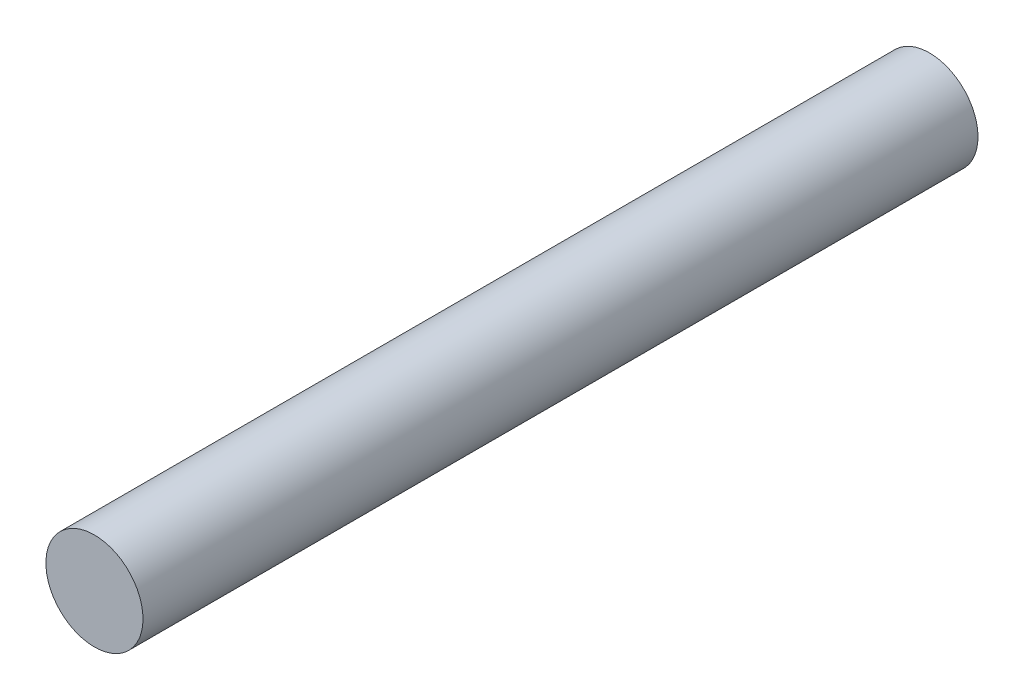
ISO-10303-21;
HEADER;
FILE_DESCRIPTION(('STEP AP214'),'2;1');
FILE_NAME('part.step','',(''),(''),'','','');
FILE_SCHEMA(('AUTOMOTIVE_DESIGN { 1 0 10303 214 1 1 1 1 }'));
ENDSEC;
DATA;
#1=APPLICATION_CONTEXT('core data for automotive mechanical design processes');
#2=APPLICATION_PROTOCOL_DEFINITION('international standard','automotive_design',2000,#1);
#3=PRODUCT_CONTEXT('',#1,'mechanical');
#4=PRODUCT('Part','Part','',(#3));
#5=PRODUCT_RELATED_PRODUCT_CATEGORY('part','',(#4));
#6=PRODUCT_DEFINITION_FORMATION('','',#4);
#7=PRODUCT_DEFINITION_CONTEXT('part definition',#1,'design');
#8=PRODUCT_DEFINITION('design','',#6,#7);
#9=PRODUCT_DEFINITION_SHAPE('','',#8);
#10=(LENGTH_UNIT() NAMED_UNIT(*) SI_UNIT(.MILLI.,.METRE.));
#11=(NAMED_UNIT(*) PLANE_ANGLE_UNIT() SI_UNIT($,.RADIAN.));
#12=(NAMED_UNIT(*) SI_UNIT($,.STERADIAN.) SOLID_ANGLE_UNIT());
#13=UNCERTAINTY_MEASURE_WITH_UNIT(LENGTH_MEASURE(1.E-05),#10,'distance_accuracy_value','');
#14=(GEOMETRIC_REPRESENTATION_CONTEXT(3) GLOBAL_UNCERTAINTY_ASSIGNED_CONTEXT((#13)) GLOBAL_UNIT_ASSIGNED_CONTEXT((#10,
#11,#12)) REPRESENTATION_CONTEXT('',''));
#15=CARTESIAN_POINT('',(0.,0.,0.));
#16=DIRECTION('',(0.,0.,1.));
#17=DIRECTION('',(1.,0.,0.));
#18=AXIS2_PLACEMENT_3D('',#15,#16,#17);
#19=CARTESIAN_POINT('',(-447.662294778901,150.72632828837,86.));
#20=DIRECTION('',(0.,0.,-1.));
#21=DIRECTION('',(-1.,0.,0.));
#22=AXIS2_PLACEMENT_3D('',#19,#20,#21);
#23=CYLINDRICAL_SURFACE('',#22,5.);
#24=CARTESIAN_POINT('',(-447.662294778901,150.72632828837,86.));
#25=DIRECTION('',(0.,0.,1.));
#26=DIRECTION('',(1.,0.,0.));
#27=AXIS2_PLACEMENT_3D('',#24,#25,#26);
#28=CIRCLE('',#27,5.);
#29=CARTESIAN_POINT('',(-442.662294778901,150.72632828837,86.));
#30=VERTEX_POINT('',#29);
#31=EDGE_CURVE('E10',#30,#30,#28,.T.);
#32=ORIENTED_EDGE('',*,*,#31,.F.);
#33=EDGE_LOOP('',(#32));
#34=FACE_BOUND('',#33,.T.);
#35=CARTESIAN_POINT('',(-447.662294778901,150.72632828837,0.));
#36=DIRECTION('',(0.,0.,1.));
#37=DIRECTION('',(1.,0.,0.));
#38=AXIS2_PLACEMENT_3D('',#35,#36,#37);
#39=CIRCLE('',#38,5.);
#40=CARTESIAN_POINT('',(-442.662294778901,150.72632828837,0.));
#41=VERTEX_POINT('',#40);
#42=EDGE_CURVE('E17',#41,#41,#39,.T.);
#43=ORIENTED_EDGE('',*,*,#42,.T.);
#44=EDGE_LOOP('',(#43));
#45=FACE_BOUND('',#44,.T.);
#46=ADVANCED_FACE('F14',(#34,#45),#23,.T.);
#47=CARTESIAN_POINT('',(-447.662294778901,150.72632828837,86.));
#48=DIRECTION('',(0.,0.,1.));
#49=DIRECTION('',(1.,0.,0.));
#50=AXIS2_PLACEMENT_3D('',#47,#48,#49);
#51=PLANE('',#50);
#52=ORIENTED_EDGE('',*,*,#31,.T.);
#53=EDGE_LOOP('',(#52));
#54=FACE_BOUND('',#53,.T.);
#55=ADVANCED_FACE('F29',(#54),#51,.T.);
#56=CARTESIAN_POINT('',(-447.662294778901,150.72632828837,0.));
#57=DIRECTION('',(0.,0.,1.));
#58=DIRECTION('',(1.,0.,0.));
#59=AXIS2_PLACEMENT_3D('',#56,#57,#58);
#60=PLANE('',#59);
#61=ORIENTED_EDGE('',*,*,#42,.F.);
#62=EDGE_LOOP('',(#61));
#63=FACE_BOUND('',#62,.T.);
#64=ADVANCED_FACE('F27',(#63),#60,.F.);
#65=CLOSED_SHELL('',(#46,#55,#64));
#66=MANIFOLD_SOLID_BREP('B1',#65);
#67=ADVANCED_BREP_SHAPE_REPRESENTATION('',(#18,#66),#14);
#68=SHAPE_DEFINITION_REPRESENTATION(#9,#67);
ENDSEC;
END-ISO-10303-21;
